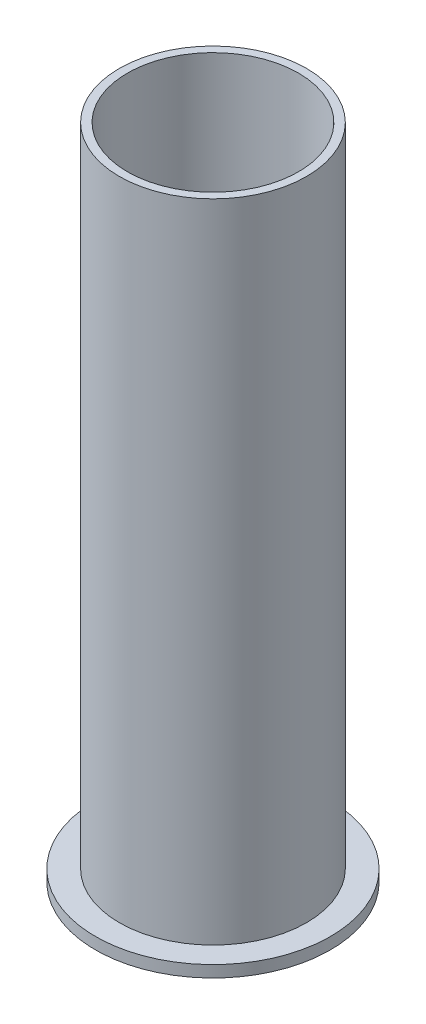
from build123d import *

# Parameters (mm, degrees)
SKETCH1_R           = 6.3246
SKETCH1_R_2         = 5.7785
BOSS_EXTRUDE1_DEPTH = 44.45
SKETCH2_R           = 7.9375
SKETCH2_R_2         = 5.7785
BOSS_EXTRUDE2_DEPTH = 0.7874


with BuildPart() as part:
    # Sketch1 → Boss-Extrude1 (new body)
    with BuildSketch(Plane(origin=(0, 0, 0), x_dir=(1, 0, 0), z_dir=(0, 1, 0))):
        with Locations(Location((0, 0, 0), (0, 0, 270))):
            Circle(SKETCH1_R)
        with Locations(Location((0, 0, 0), (0, 0, 270))):
            Circle(SKETCH1_R_2, mode=Mode.SUBTRACT)
    extrude(amount=BOSS_EXTRUDE1_DEPTH)

    # Sketch2 → Boss-Extrude2 (add)
    with BuildSketch(Plane.XZ):
        with Locations(Location((0, 0, 0), (0, 0, 270))):
            Circle(SKETCH2_R)
        with Locations(Location((0, 0, 0), (0, 0, 90))):
            Circle(SKETCH2_R_2, mode=Mode.SUBTRACT)
    extrude(amount=-BOSS_EXTRUDE2_DEPTH)


solid = part.part
